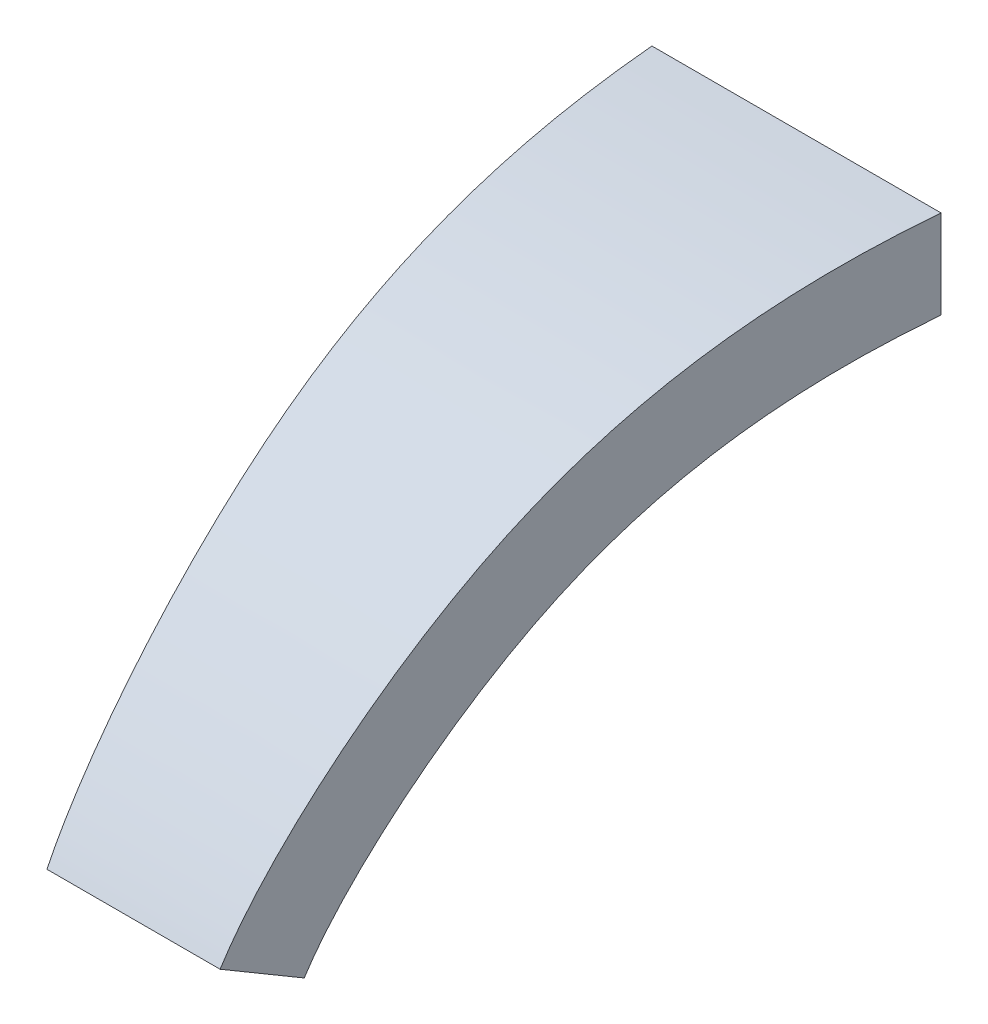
ISO-10303-21;
HEADER;
FILE_DESCRIPTION(('STEP AP214'),'2;1');
FILE_NAME('part.step','',(''),(''),'','','');
FILE_SCHEMA(('AUTOMOTIVE_DESIGN { 1 0 10303 214 1 1 1 1 }'));
ENDSEC;
DATA;
#1=APPLICATION_CONTEXT('core data for automotive mechanical design processes');
#2=APPLICATION_PROTOCOL_DEFINITION('international standard','automotive_design',2000,#1);
#3=PRODUCT_CONTEXT('',#1,'mechanical');
#4=PRODUCT('Part','Part','',(#3));
#5=PRODUCT_RELATED_PRODUCT_CATEGORY('part','',(#4));
#6=PRODUCT_DEFINITION_FORMATION('','',#4);
#7=PRODUCT_DEFINITION_CONTEXT('part definition',#1,'design');
#8=PRODUCT_DEFINITION('design','',#6,#7);
#9=PRODUCT_DEFINITION_SHAPE('','',#8);
#10=(LENGTH_UNIT() NAMED_UNIT(*) SI_UNIT(.MILLI.,.METRE.));
#11=(NAMED_UNIT(*) PLANE_ANGLE_UNIT() SI_UNIT($,.RADIAN.));
#12=(NAMED_UNIT(*) SI_UNIT($,.STERADIAN.) SOLID_ANGLE_UNIT());
#13=UNCERTAINTY_MEASURE_WITH_UNIT(LENGTH_MEASURE(1.E-05),#10,'distance_accuracy_value','');
#14=(GEOMETRIC_REPRESENTATION_CONTEXT(3) GLOBAL_UNCERTAINTY_ASSIGNED_CONTEXT((#13)) GLOBAL_UNIT_ASSIGNED_CONTEXT((#10,
#11,#12)) REPRESENTATION_CONTEXT('',''));
#15=CARTESIAN_POINT('',(0.,0.,0.));
#16=DIRECTION('',(0.,0.,1.));
#17=DIRECTION('',(1.,0.,0.));
#18=AXIS2_PLACEMENT_3D('',#15,#16,#17);
#19=CARTESIAN_POINT('',(12.5,0.,0.));
#20=CARTESIAN_POINT('',(12.5,0.,11.7263333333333));
#21=CARTESIAN_POINT('',(12.5,-3.57446420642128,33.9708660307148));
#22=CARTESIAN_POINT('',(12.5,-23.6672955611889,53.5514562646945));
#23=CARTESIAN_POINT('',(12.5,-30.48,57.3278));
#24=B_SPLINE_CURVE_WITH_KNOTS('',3,(#19,#20,#21,#22,#23),.UNSPECIFIED.,.F.,.F.,(4,1,4),(0.,
0.526025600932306,1.),.UNSPECIFIED.);
#25=DIRECTION('',(-1.,0.,0.));
#26=VECTOR('',#25,1.);
#27=SURFACE_OF_LINEAR_EXTRUSION('',#24,#26);
#28=CARTESIAN_POINT('',(-12.5,0.,0.));
#29=CARTESIAN_POINT('',(-12.4438982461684,4.45529158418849E-08,0.641245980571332));
#30=CARTESIAN_POINT('',(-12.3877948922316,-0.00562268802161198,1.28251025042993));
#31=CARTESIAN_POINT('',(-12.2755037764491,-0.0290246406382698,2.56600357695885));
#32=CARTESIAN_POINT('',(-12.2193160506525,-0.0468263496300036,3.20823222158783));
#33=CARTESIAN_POINT('',(-12.1069123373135,-0.0955344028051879,4.49301254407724));
#34=CARTESIAN_POINT('',(-12.0506964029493,-0.126457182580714,5.13556361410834));
#35=CARTESIAN_POINT('',(-11.9382934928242,-0.202329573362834,6.4203347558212));
#36=CARTESIAN_POINT('',(-11.8821065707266,-0.247289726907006,7.06255421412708));
#37=CARTESIAN_POINT('',(-11.769818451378,-0.352127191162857,8.34601329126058));
#38=CARTESIAN_POINT('',(-11.7137172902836,-0.412009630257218,8.98725249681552));
#39=CARTESIAN_POINT('',(-11.601657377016,-0.547543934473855,10.268103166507));
#40=CARTESIAN_POINT('',(-11.5456986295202,-0.62319631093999,10.907714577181));
#41=CARTESIAN_POINT('',(-11.4340031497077,-0.791043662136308,12.1843997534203));
#42=CARTESIAN_POINT('',(-11.3782663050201,-0.883228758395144,12.8214748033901));
#43=CARTESIAN_POINT('',(-11.2670501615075,-1.08491404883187,14.0926811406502));
#44=CARTESIAN_POINT('',(-11.2115707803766,-1.19440825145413,14.7268133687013));
#45=CARTESIAN_POINT('',(-11.1009253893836,-1.4314084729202,15.9914959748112));
#46=CARTESIAN_POINT('',(-11.0457592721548,-1.55890787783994,16.6220475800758));
#47=CARTESIAN_POINT('',(-10.9357951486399,-1.83255316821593,17.8789432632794));
#48=CARTESIAN_POINT('',(-10.8809970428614,-1.97869378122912,18.5052884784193));
#49=CARTESIAN_POINT('',(-10.771822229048,-2.29019063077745,19.7531623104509));
#50=CARTESIAN_POINT('',(-10.7174454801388,-2.45554497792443,20.3746913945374));
#51=CARTESIAN_POINT('',(-10.6091660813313,-2.8059630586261,21.6123305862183));
#52=CARTESIAN_POINT('',(-10.5552635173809,-2.99103028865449,22.2284397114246));
#53=CARTESIAN_POINT('',(-10.436344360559,-3.42363986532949,23.5876918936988));
#54=CARTESIAN_POINT('',(-10.3714607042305,-3.676015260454,24.3293154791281));
#55=CARTESIAN_POINT('',(-10.2426181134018,-4.21092969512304,25.8019930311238));
#56=CARTESIAN_POINT('',(-10.1786595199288,-4.49347955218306,26.5330430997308));
#57=CARTESIAN_POINT('',(-10.0518154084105,-5.08875502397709,27.9828779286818));
#58=CARTESIAN_POINT('',(-9.9889299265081,-5.40148165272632,28.7016622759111));
#59=CARTESIAN_POINT('',(-9.8643667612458,-6.05683441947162,30.1254257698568));
#60=CARTESIAN_POINT('',(-9.80268882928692,-6.39945432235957,30.8304077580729));
#61=CARTESIAN_POINT('',(-9.71117085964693,-6.93536037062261,31.8764629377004));
#62=CARTESIAN_POINT('',(-9.68083682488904,-7.11762300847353,32.2231825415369));
#63=CARTESIAN_POINT('',(-9.62050807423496,-7.48940735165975,32.9127433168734));
#64=CARTESIAN_POINT('',(-9.59051335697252,-7.67892902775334,33.2555845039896));
#65=CARTESIAN_POINT('',(-9.53095291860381,-8.06464909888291,33.9363634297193));
#66=CARTESIAN_POINT('',(-9.50138629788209,-8.26082921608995,34.2743114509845));
#67=CARTESIAN_POINT('',(-9.44261191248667,-8.66014130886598,34.9461057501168));
#68=CARTESIAN_POINT('',(-9.4134041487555,-8.86327330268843,35.2799520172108));
#69=CARTESIAN_POINT('',(-9.3553381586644,-9.2760426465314,35.9436493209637));
#70=CARTESIAN_POINT('',(-9.32647994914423,-9.485680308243,36.2735001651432));
#71=CARTESIAN_POINT('',(-9.26910961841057,-9.91108998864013,36.9292460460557));
#72=CARTESIAN_POINT('',(-9.24059749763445,-10.1268620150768,37.2551410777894));
#73=CARTESIAN_POINT('',(-9.15555211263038,-10.7830347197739,38.2272142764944));
#74=CARTESIAN_POINT('',(-9.09952814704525,-11.2321613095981,38.8675711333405));
#75=CARTESIAN_POINT('',(-8.98879539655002,-12.1516473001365,40.1332522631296));
#76=CARTESIAN_POINT('',(-8.93408706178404,-12.6220138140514,40.7585713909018));
#77=CARTESIAN_POINT('',(-8.82598141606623,-13.5823190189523,41.9942245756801));
#78=CARTESIAN_POINT('',(-8.77258425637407,-14.0722599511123,42.6045569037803));
#79=CARTESIAN_POINT('',(-8.67367624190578,-15.0083664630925,43.7350806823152));
#80=CARTESIAN_POINT('',(-8.62801108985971,-15.4523896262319,44.2570357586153));
#81=CARTESIAN_POINT('',(-8.53772507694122,-16.3538173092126,45.2890096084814));
#82=CARTESIAN_POINT('',(-8.49310383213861,-16.8112167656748,45.7990327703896));
#83=CARTESIAN_POINT('',(-8.40492903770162,-17.739119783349,46.8068752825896));
#84=CARTESIAN_POINT('',(-8.36137522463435,-18.2096200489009,47.3046976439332));
#85=CARTESIAN_POINT('',(-8.27537705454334,-19.1636792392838,48.2876612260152));
#86=CARTESIAN_POINT('',(-8.23293257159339,-19.6472366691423,48.7728038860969));
#87=CARTESIAN_POINT('',(-8.14921662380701,-20.6276349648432,49.7296815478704));
#88=CARTESIAN_POINT('',(-8.10794526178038,-21.1244769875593,50.2014153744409));
#89=CARTESIAN_POINT('',(-8.02651401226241,-22.1339207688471,51.1321788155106));
#90=CARTESIAN_POINT('',(-7.9863595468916,-22.6465801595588,51.5911464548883));
#91=CARTESIAN_POINT('',(-7.90749286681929,-23.6864441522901,52.4925967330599));
#92=CARTESIAN_POINT('',(-7.86878078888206,-24.2136501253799,52.9350778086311));
#93=CARTESIAN_POINT('',(-7.81198171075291,-25.0160739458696,53.5842942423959));
#94=CARTESIAN_POINT('',(-7.79326377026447,-25.2854299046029,53.7982412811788));
#95=CARTESIAN_POINT('',(-7.75628781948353,-25.8282627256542,54.2208783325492));
#96=CARTESIAN_POINT('',(-7.73802979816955,-26.10173948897,54.4295684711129));
#97=CARTESIAN_POINT('',(-7.70203011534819,-26.6529335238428,54.8410467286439));
#98=CARTESIAN_POINT('',(-7.68428820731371,-26.9306486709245,55.0438376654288));
#99=CARTESIAN_POINT('',(-7.65810192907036,-27.3507362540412,55.3431481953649));
#100=CARTESIAN_POINT('',(-7.64944382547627,-27.4913587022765,55.4421107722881));
#101=CARTESIAN_POINT('',(-7.63227950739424,-27.7738185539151,55.638299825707));
#102=CARTESIAN_POINT('',(-7.6237732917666,-27.9156559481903,55.7355263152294));
#103=CARTESIAN_POINT('',(-7.60691685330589,-28.200704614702,55.9281962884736));
#104=CARTESIAN_POINT('',(-7.59856675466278,-28.3439168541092,56.0236383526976));
#105=CARTESIAN_POINT('',(-7.58204125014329,-28.6316676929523,56.2125257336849));
#106=CARTESIAN_POINT('',(-7.5738658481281,-28.7762063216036,56.3059710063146));
#107=CARTESIAN_POINT('',(-7.5577056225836,-29.0666405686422,56.4906832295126));
#108=CARTESIAN_POINT('',(-7.54972076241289,-29.212535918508,56.5819505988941));
#109=CARTESIAN_POINT('',(-7.53395665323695,-29.5057744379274,56.7621351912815));
#110=CARTESIAN_POINT('',(-7.52617739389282,-29.6531175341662,56.8510525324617));
#111=CARTESIAN_POINT('',(-7.51542925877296,-29.8607488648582,56.9739042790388));
#112=CARTESIAN_POINT('',(-7.51236612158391,-29.9203964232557,57.0089160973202));
#113=CARTESIAN_POINT('',(-7.50627753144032,-30.039943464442,57.0785090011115));
#114=CARTESIAN_POINT('',(-7.50325207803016,-30.0998429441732,57.1130900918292));
#115=CARTESIAN_POINT('',(-7.49724050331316,-30.2199038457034,57.1818027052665));
#116=CARTESIAN_POINT('',(-7.49425438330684,-30.2800652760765,57.2159342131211));
#117=CARTESIAN_POINT('',(-7.4898051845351,-30.3705019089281,57.2667887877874));
#118=CARTESIAN_POINT('',(-7.48832710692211,-30.4006800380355,57.2836832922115));
#119=CARTESIAN_POINT('',(-7.48538252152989,-30.4611105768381,57.3173400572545));
#120=CARTESIAN_POINT('',(-7.48391601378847,-30.4913629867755,57.3341023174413));
#121=CARTESIAN_POINT('',(-7.47951554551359,-30.5821223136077,57.3843998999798));
#122=CARTESIAN_POINT('',(-7.47658094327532,-30.6426250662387,57.417942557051));
#123=CARTESIAN_POINT('',(-7.47071221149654,-30.7636332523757,57.4850224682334));
#124=CARTESIAN_POINT('',(-7.46777808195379,-30.8241386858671,57.51855972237));
#125=CARTESIAN_POINT('',(-7.46190973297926,-30.9451480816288,57.5856352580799));
#126=CARTESIAN_POINT('',(-7.45897551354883,-31.0056520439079,57.6191735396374));
#127=CARTESIAN_POINT('',(-7.45310710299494,-31.1266602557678,57.6862497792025));
#128=CARTESIAN_POINT('',(-7.45017291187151,-31.187164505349,57.7197877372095));
#129=CARTESIAN_POINT('',(-7.44136602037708,-31.36876605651,57.8204509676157));
#130=CARTESIAN_POINT('',(-7.43549331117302,-31.4898633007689,57.8875763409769));
#131=CARTESIAN_POINT('',(-7.42374787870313,-31.7320582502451,58.0218272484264));
#132=CARTESIAN_POINT('',(-7.41787515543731,-31.8531559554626,58.0889527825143));
#133=CARTESIAN_POINT('',(-7.40613005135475,-32.0953442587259,58.2231999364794));
#134=CARTESIAN_POINT('',(-7.4002576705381,-32.2164348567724,58.2903215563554));
#135=CARTESIAN_POINT('',(-7.38851291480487,-32.4586159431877,58.4245647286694));
#136=CARTESIAN_POINT('',(-7.38264053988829,-32.5797064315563,58.4916862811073));
#137=CARTESIAN_POINT('',(-7.36501549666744,-32.943141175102,58.69314144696));
#138=CARTESIAN_POINT('',(-7.35326282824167,-33.1854854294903,58.8274750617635));
#139=CARTESIAN_POINT('',(-7.32975731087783,-33.6701776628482,59.0961443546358));
#140=CARTESIAN_POINT('',(-7.31800446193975,-33.9125256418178,59.2304800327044));
#141=CARTESIAN_POINT('',(-7.29449308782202,-34.3973386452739,59.4992162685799));
#142=CARTESIAN_POINT('',(-7.28273456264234,-34.6398036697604,59.633616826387));
#143=CARTESIAN_POINT('',(-7.25921756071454,-35.1247327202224,59.9024173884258));
#144=CARTESIAN_POINT('',(-7.24745908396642,-35.3671967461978,60.0368173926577));
#145=CARTESIAN_POINT('',(-7.21217596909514,-36.0947472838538,60.4401052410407));
#146=CARTESIAN_POINT('',(-7.18865133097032,-36.5798337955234,60.708993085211));
#147=CARTESIAN_POINT('',(-7.1415982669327,-37.5500849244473,61.2468120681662));
#148=CARTESIAN_POINT('',(-7.11806984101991,-38.0352495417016,61.515743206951));
#149=CARTESIAN_POINT('',(-7.07118993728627,-39.0019300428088,62.0515829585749));
#150=CARTESIAN_POINT('',(-7.04783845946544,-39.4834459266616,62.3184915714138));
#151=CARTESIAN_POINT('',(-7.00113945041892,-40.4463963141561,62.8522636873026));
#152=CARTESIAN_POINT('',(-6.97779191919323,-40.9278308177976,63.1191271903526));
#153=CARTESIAN_POINT('',(-6.93110469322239,-41.890538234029,63.6527646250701));
#154=CARTESIAN_POINT('',(-6.90776499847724,-42.3718111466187,63.9195385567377));
#155=CARTESIAN_POINT('',(-6.86109733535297,-43.3341151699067,64.4529523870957));
#156=CARTESIAN_POINT('',(-6.83776936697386,-43.8151462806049,64.7195922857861));
#157=CARTESIAN_POINT('',(-6.79112904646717,-44.7768864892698,65.2526935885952));
#158=CARTESIAN_POINT('',(-6.76781669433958,-45.2575955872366,65.5191549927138));
#159=CARTESIAN_POINT('',(-6.72121149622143,-46.2186115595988,66.0518548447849));
#160=CARTESIAN_POINT('',(-6.69791865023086,-46.6989184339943,66.3180932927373));
#161=CARTESIAN_POINT('',(-6.67462580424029,-47.1792253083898,66.5843317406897));
#162=B_SPLINE_CURVE_WITH_KNOTS('',3,(#28,#29,#30,#31,#32,#33,#34,#35,#36,#37,#38,#39,#40,#41,
#42,#43,#44,#45,#46,#47,#48,#49,#50,#51,#52,#53,#54,#55,#56,#57,#58,#59,#60,#61,#62,#63,#64,#65,
#66,#67,#68,#69,#70,#71,#72,#73,#74,#75,#76,#77,#78,#79,#80,#81,#82,#83,#84,#85,#86,#87,#88,#89,
#90,#91,#92,#93,#94,#95,#96,#97,#98,#99,#100,#101,#102,#103,#104,#105,#106,#107,#108,#109,#110,
#111,#112,#113,#114,#115,#116,#117,#118,#119,#120,#121,#122,#123,#124,#125,#126,#127,#128,#129,
#130,#131,#132,#133,#134,#135,#136,#137,#138,#139,#140,#141,#142,#143,#144,#145,#146,#147,#148,
#149,#150,#151,#152,#153,#154,#155,#156,#157,#158,#159,#160,#161),.UNSPECIFIED.,.F.,.F.,(4,2,2,
2,2,2,2,2,2,2,2,2,2,2,2,2,2,2,2,2,2,2,2,2,2,2,2,2,2,2,2,2,2,2,2,2,2,2,2,2,2,2,2,2,2,2,2,2,2,2,2,
2,2,2,2,2,2,2,2,2,2,2,2,2,2,2,4),(0.,1.93108904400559,3.86575357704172,5.8028486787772,
7.74140211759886,9.68062270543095,11.6199061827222,13.5580347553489,15.4954939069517,
17.4322432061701,19.3684459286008,21.3044584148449,23.2408148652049,25.5983774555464,
27.9567880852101,30.3152779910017,32.6732771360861,33.851844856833,35.0304078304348,
36.2059624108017,37.3815200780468,38.5571341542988,39.7327497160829,42.0847230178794,
44.4374899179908,46.7905269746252,48.8506638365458,50.9100307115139,52.9688841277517,
55.0275028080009,57.0863013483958,59.1537833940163,61.221460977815,62.2548907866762,
63.2882958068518,64.3211988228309,64.8377043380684,65.354205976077,65.8711023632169,
66.3880101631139,66.9048177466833,67.4215992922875,67.62929330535,67.8369848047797,
68.0446831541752,68.1485334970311,68.2523841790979,68.4601070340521,68.6678288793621,
68.8755484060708,69.0832682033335,69.4990128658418,69.9147589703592,70.3304807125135,
70.7462020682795,71.5782053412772,72.4102213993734,73.2426392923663,74.075053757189,
75.7404267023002,77.4060677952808,79.0591822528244,80.7120173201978,82.3642976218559,
84.0157477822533,85.666092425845,87.3150561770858),.UNSPECIFIED.);
#163=CARTESIAN_POINT('',(-12.5,0.,0.));
#164=VERTEX_POINT('',#163);
#165=CARTESIAN_POINT('',(-7.48446739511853,-30.48,57.3278));
#166=VERTEX_POINT('',#165);
#167=EDGE_CURVE('E85',#164,#166,#162,.T.);
#168=ORIENTED_EDGE('',*,*,#167,.T.);
#169=DIRECTION('',(-1.,0.,0.));
#170=VECTOR('',#169,1.);
#171=CARTESIAN_POINT('',(12.5,-30.48,57.3278));
#172=LINE('',#171,#170);
#173=CARTESIAN_POINT('',(7.48446739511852,-30.48,57.3278));
#174=VERTEX_POINT('',#173);
#175=EDGE_CURVE('E11',#174,#166,#172,.T.);
#176=ORIENTED_EDGE('',*,*,#175,.F.);
#177=CARTESIAN_POINT('',(12.5,0.,0.));
#178=CARTESIAN_POINT('',(12.4438982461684,4.4552915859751E-08,0.64124598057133));
#179=CARTESIAN_POINT('',(12.3877948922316,-0.00562268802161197,1.28251025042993));
#180=CARTESIAN_POINT('',(12.2755037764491,-0.0290246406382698,2.56600357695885));
#181=CARTESIAN_POINT('',(12.2193160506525,-0.0468263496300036,3.20823222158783));
#182=CARTESIAN_POINT('',(12.1069123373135,-0.095534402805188,4.49301254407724));
#183=CARTESIAN_POINT('',(12.0506964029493,-0.126457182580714,5.13556361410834));
#184=CARTESIAN_POINT('',(11.9382934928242,-0.202329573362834,6.4203347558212));
#185=CARTESIAN_POINT('',(11.8821065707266,-0.247289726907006,7.06255421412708));
#186=CARTESIAN_POINT('',(11.769818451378,-0.352127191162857,8.34601329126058));
#187=CARTESIAN_POINT('',(11.7137172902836,-0.412009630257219,8.98725249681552));
#188=CARTESIAN_POINT('',(11.601657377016,-0.547543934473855,10.268103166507));
#189=CARTESIAN_POINT('',(11.5456986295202,-0.62319631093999,10.9077145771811));
#190=CARTESIAN_POINT('',(11.4340031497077,-0.791043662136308,12.1843997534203));
#191=CARTESIAN_POINT('',(11.3782663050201,-0.883228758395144,12.8214748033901));
#192=CARTESIAN_POINT('',(11.2670501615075,-1.08491404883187,14.0926811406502));
#193=CARTESIAN_POINT('',(11.2115707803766,-1.19440825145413,14.7268133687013));
#194=CARTESIAN_POINT('',(11.1009253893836,-1.4314084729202,15.9914959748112));
#195=CARTESIAN_POINT('',(11.0457592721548,-1.55890787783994,16.6220475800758));
#196=CARTESIAN_POINT('',(10.9357951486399,-1.83255316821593,17.8789432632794));
#197=CARTESIAN_POINT('',(10.8809970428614,-1.97869378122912,18.5052884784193));
#198=CARTESIAN_POINT('',(10.771822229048,-2.29019063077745,19.7531623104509));
#199=CARTESIAN_POINT('',(10.7174454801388,-2.45554497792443,20.3746913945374));
#200=CARTESIAN_POINT('',(10.6091660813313,-2.8059630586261,21.6123305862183));
#201=CARTESIAN_POINT('',(10.5552635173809,-2.99103028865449,22.2284397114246));
#202=CARTESIAN_POINT('',(10.436344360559,-3.42363986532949,23.5876918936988));
#203=CARTESIAN_POINT('',(10.3714607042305,-3.676015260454,24.3293154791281));
#204=CARTESIAN_POINT('',(10.2426181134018,-4.21092969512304,25.8019930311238));
#205=CARTESIAN_POINT('',(10.1786595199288,-4.49347955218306,26.5330430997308));
#206=CARTESIAN_POINT('',(10.0518154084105,-5.08875502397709,27.9828779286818));
#207=CARTESIAN_POINT('',(9.9889299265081,-5.40148165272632,28.7016622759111));
#208=CARTESIAN_POINT('',(9.8643667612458,-6.05683441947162,30.1254257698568));
#209=CARTESIAN_POINT('',(9.80268882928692,-6.39945432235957,30.8304077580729));
#210=CARTESIAN_POINT('',(9.71117085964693,-6.93536037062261,31.8764629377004));
#211=CARTESIAN_POINT('',(9.68083682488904,-7.11762300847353,32.2231825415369));
#212=CARTESIAN_POINT('',(9.62050807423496,-7.48940735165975,32.9127433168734));
#213=CARTESIAN_POINT('',(9.59051335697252,-7.67892902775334,33.2555845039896));
#214=CARTESIAN_POINT('',(9.53095291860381,-8.06464909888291,33.9363634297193));
#215=CARTESIAN_POINT('',(9.50138629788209,-8.26082921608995,34.2743114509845));
#216=CARTESIAN_POINT('',(9.44261191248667,-8.66014130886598,34.9461057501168));
#217=CARTESIAN_POINT('',(9.4134041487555,-8.86327330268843,35.2799520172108));
#218=CARTESIAN_POINT('',(9.3553381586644,-9.2760426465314,35.9436493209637));
#219=CARTESIAN_POINT('',(9.32647994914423,-9.485680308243,36.2735001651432));
#220=CARTESIAN_POINT('',(9.26910961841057,-9.91108998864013,36.9292460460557));
#221=CARTESIAN_POINT('',(9.24059749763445,-10.1268620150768,37.2551410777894));
#222=CARTESIAN_POINT('',(9.15555211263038,-10.7830347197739,38.2272142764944));
#223=CARTESIAN_POINT('',(9.09952814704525,-11.2321613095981,38.8675711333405));
#224=CARTESIAN_POINT('',(8.98879539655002,-12.1516473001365,40.1332522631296));
#225=CARTESIAN_POINT('',(8.93408706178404,-12.6220138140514,40.7585713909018));
#226=CARTESIAN_POINT('',(8.82598141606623,-13.5823190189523,41.9942245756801));
#227=CARTESIAN_POINT('',(8.77258425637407,-14.0722599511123,42.6045569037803));
#228=CARTESIAN_POINT('',(8.67367624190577,-15.0083664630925,43.7350806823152));
#229=CARTESIAN_POINT('',(8.62801108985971,-15.4523896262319,44.2570357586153));
#230=CARTESIAN_POINT('',(8.53772507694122,-16.3538173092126,45.2890096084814));
#231=CARTESIAN_POINT('',(8.49310383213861,-16.8112167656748,45.7990327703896));
#232=CARTESIAN_POINT('',(8.40492903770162,-17.739119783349,46.8068752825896));
#233=CARTESIAN_POINT('',(8.36137522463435,-18.2096200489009,47.3046976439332));
#234=CARTESIAN_POINT('',(8.27537705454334,-19.1636792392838,48.2876612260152));
#235=CARTESIAN_POINT('',(8.23293257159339,-19.6472366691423,48.7728038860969));
#236=CARTESIAN_POINT('',(8.14921662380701,-20.6276349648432,49.7296815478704));
#237=CARTESIAN_POINT('',(8.10794526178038,-21.1244769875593,50.2014153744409));
#238=CARTESIAN_POINT('',(8.02651401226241,-22.1339207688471,51.1321788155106));
#239=CARTESIAN_POINT('',(7.9863595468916,-22.6465801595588,51.5911464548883));
#240=CARTESIAN_POINT('',(7.90749286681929,-23.6864441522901,52.4925967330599));
#241=CARTESIAN_POINT('',(7.86878078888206,-24.2136501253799,52.9350778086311));
#242=CARTESIAN_POINT('',(7.81198171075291,-25.0160739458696,53.5842942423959));
#243=CARTESIAN_POINT('',(7.79326377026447,-25.2854299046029,53.7982412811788));
#244=CARTESIAN_POINT('',(7.75628781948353,-25.8282627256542,54.2208783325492));
#245=CARTESIAN_POINT('',(7.73802979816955,-26.10173948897,54.4295684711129));
#246=CARTESIAN_POINT('',(7.70203011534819,-26.6529335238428,54.8410467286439));
#247=CARTESIAN_POINT('',(7.68428820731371,-26.9306486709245,55.0438376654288));
#248=CARTESIAN_POINT('',(7.65810192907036,-27.3507362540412,55.3431481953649));
#249=CARTESIAN_POINT('',(7.64944382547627,-27.4913587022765,55.4421107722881));
#250=CARTESIAN_POINT('',(7.63227950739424,-27.7738185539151,55.638299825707));
#251=CARTESIAN_POINT('',(7.6237732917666,-27.9156559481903,55.7355263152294));
#252=CARTESIAN_POINT('',(7.60691685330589,-28.200704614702,55.9281962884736));
#253=CARTESIAN_POINT('',(7.59856675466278,-28.3439168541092,56.0236383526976));
#254=CARTESIAN_POINT('',(7.58204125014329,-28.6316676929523,56.2125257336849));
#255=CARTESIAN_POINT('',(7.5738658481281,-28.7762063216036,56.3059710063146));
#256=CARTESIAN_POINT('',(7.5577056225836,-29.0666405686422,56.4906832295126));
#257=CARTESIAN_POINT('',(7.54972076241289,-29.212535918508,56.5819505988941));
#258=CARTESIAN_POINT('',(7.53395665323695,-29.5057744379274,56.7621351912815));
#259=CARTESIAN_POINT('',(7.52617739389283,-29.6531175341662,56.8510525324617));
#260=CARTESIAN_POINT('',(7.51542925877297,-29.8607488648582,56.9739042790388));
#261=CARTESIAN_POINT('',(7.51236612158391,-29.9203964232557,57.0089160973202));
#262=CARTESIAN_POINT('',(7.50627753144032,-30.039943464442,57.0785090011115));
#263=CARTESIAN_POINT('',(7.50325207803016,-30.0998429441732,57.1130900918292));
#264=CARTESIAN_POINT('',(7.49724050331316,-30.2199038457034,57.1818027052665));
#265=CARTESIAN_POINT('',(7.49425438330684,-30.2800652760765,57.2159342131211));
#266=CARTESIAN_POINT('',(7.4898051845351,-30.3705019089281,57.2667887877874));
#267=CARTESIAN_POINT('',(7.48832710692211,-30.4006800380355,57.2836832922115));
#268=CARTESIAN_POINT('',(7.48538252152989,-30.4611105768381,57.3173400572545));
#269=CARTESIAN_POINT('',(7.48391601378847,-30.4913629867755,57.3341023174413));
#270=CARTESIAN_POINT('',(7.47951554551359,-30.5821223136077,57.3843998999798));
#271=CARTESIAN_POINT('',(7.47658094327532,-30.6426250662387,57.417942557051));
#272=CARTESIAN_POINT('',(7.47071221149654,-30.7636332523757,57.4850224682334));
#273=CARTESIAN_POINT('',(7.46777808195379,-30.8241386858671,57.51855972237));
#274=CARTESIAN_POINT('',(7.46190973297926,-30.9451480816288,57.5856352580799));
#275=CARTESIAN_POINT('',(7.45897551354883,-31.0056520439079,57.6191735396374));
#276=CARTESIAN_POINT('',(7.45310710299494,-31.1266602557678,57.6862497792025));
#277=CARTESIAN_POINT('',(7.45017291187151,-31.187164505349,57.7197877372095));
#278=CARTESIAN_POINT('',(7.44136602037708,-31.36876605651,57.8204509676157));
#279=CARTESIAN_POINT('',(7.43549331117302,-31.4898633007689,57.8875763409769));
#280=CARTESIAN_POINT('',(7.42374787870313,-31.7320582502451,58.0218272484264));
#281=CARTESIAN_POINT('',(7.41787515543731,-31.8531559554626,58.0889527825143));
#282=CARTESIAN_POINT('',(7.40613005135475,-32.0953442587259,58.2231999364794));
#283=CARTESIAN_POINT('',(7.4002576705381,-32.2164348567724,58.2903215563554));
#284=CARTESIAN_POINT('',(7.38851291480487,-32.4586159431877,58.4245647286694));
#285=CARTESIAN_POINT('',(7.38264053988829,-32.5797064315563,58.4916862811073));
#286=CARTESIAN_POINT('',(7.36501549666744,-32.943141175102,58.69314144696));
#287=CARTESIAN_POINT('',(7.35326282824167,-33.1854854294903,58.8274750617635));
#288=CARTESIAN_POINT('',(7.32975731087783,-33.6701776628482,59.0961443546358));
#289=CARTESIAN_POINT('',(7.31800446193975,-33.9125256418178,59.2304800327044));
#290=CARTESIAN_POINT('',(7.29449308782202,-34.3973386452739,59.4992162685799));
#291=CARTESIAN_POINT('',(7.28273456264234,-34.6398036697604,59.633616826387));
#292=CARTESIAN_POINT('',(7.25921756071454,-35.1247327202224,59.9024173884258));
#293=CARTESIAN_POINT('',(7.24745908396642,-35.3671967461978,60.0368173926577));
#294=CARTESIAN_POINT('',(7.21217596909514,-36.0947472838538,60.4401052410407));
#295=CARTESIAN_POINT('',(7.18865133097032,-36.5798337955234,60.708993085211));
#296=CARTESIAN_POINT('',(7.1415982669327,-37.5500849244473,61.2468120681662));
#297=CARTESIAN_POINT('',(7.11806984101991,-38.0352495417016,61.515743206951));
#298=CARTESIAN_POINT('',(7.07118993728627,-39.0019300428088,62.0515829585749));
#299=CARTESIAN_POINT('',(7.04783845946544,-39.4834459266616,62.3184915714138));
#300=CARTESIAN_POINT('',(7.00113945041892,-40.4463963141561,62.8522636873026));
#301=CARTESIAN_POINT('',(6.97779191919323,-40.9278308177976,63.1191271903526));
#302=CARTESIAN_POINT('',(6.93110469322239,-41.890538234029,63.6527646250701));
#303=CARTESIAN_POINT('',(6.90776499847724,-42.3718111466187,63.9195385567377));
#304=CARTESIAN_POINT('',(6.86109733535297,-43.3341151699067,64.4529523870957));
#305=CARTESIAN_POINT('',(6.83776936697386,-43.8151462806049,64.7195922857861));
#306=CARTESIAN_POINT('',(6.79112904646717,-44.7768864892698,65.2526935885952));
#307=CARTESIAN_POINT('',(6.76781669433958,-45.2575955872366,65.5191549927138));
#308=CARTESIAN_POINT('',(6.72121149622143,-46.2186115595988,66.0518548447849));
#309=CARTESIAN_POINT('',(6.69791865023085,-46.6989184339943,66.3180932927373));
#310=CARTESIAN_POINT('',(6.67462580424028,-47.1792253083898,66.5843317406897));
#311=B_SPLINE_CURVE_WITH_KNOTS('',3,(#177,#178,#179,#180,#181,#182,#183,#184,#185,#186,#187,
#188,#189,#190,#191,#192,#193,#194,#195,#196,#197,#198,#199,#200,#201,#202,#203,#204,#205,#206,
#207,#208,#209,#210,#211,#212,#213,#214,#215,#216,#217,#218,#219,#220,#221,#222,#223,#224,#225,
#226,#227,#228,#229,#230,#231,#232,#233,#234,#235,#236,#237,#238,#239,#240,#241,#242,#243,#244,
#245,#246,#247,#248,#249,#250,#251,#252,#253,#254,#255,#256,#257,#258,#259,#260,#261,#262,#263,
#264,#265,#266,#267,#268,#269,#270,#271,#272,#273,#274,#275,#276,#277,#278,#279,#280,#281,#282,
#283,#284,#285,#286,#287,#288,#289,#290,#291,#292,#293,#294,#295,#296,#297,#298,#299,#300,#301,
#302,#303,#304,#305,#306,#307,#308,#309,#310),.UNSPECIFIED.,.F.,.F.,(4,2,2,2,2,2,2,2,2,2,2,2,2,
2,2,2,2,2,2,2,2,2,2,2,2,2,2,2,2,2,2,2,2,2,2,2,2,2,2,2,2,2,2,2,2,2,2,2,2,2,2,2,2,2,2,2,2,2,2,2,2,
2,2,2,2,2,4),(0.,1.93108904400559,3.86575357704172,5.8028486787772,7.74140211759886,
9.68062270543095,11.6199061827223,13.5580347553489,15.4954939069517,17.4322432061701,
19.3684459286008,21.3044584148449,23.2408148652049,25.5983774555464,27.9567880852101,
30.3152779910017,32.6732771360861,33.851844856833,35.0304078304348,36.2059624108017,
37.3815200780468,38.5571341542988,39.7327497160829,42.0847230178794,44.4374899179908,
46.7905269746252,48.8506638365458,50.9100307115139,52.9688841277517,55.0275028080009,
57.0863013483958,59.1537833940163,61.221460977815,62.2548907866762,63.2882958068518,
64.3211988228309,64.8377043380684,65.354205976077,65.8711023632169,66.3880101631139,
66.9048177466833,67.4215992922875,67.62929330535,67.8369848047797,68.0446831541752,
68.1485334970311,68.2523841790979,68.4601070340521,68.6678288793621,68.8755484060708,
69.0832682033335,69.4990128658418,69.9147589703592,70.3304807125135,70.7462020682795,
71.5782053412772,72.4102213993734,73.2426392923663,74.075053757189,75.7404267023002,
77.4060677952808,79.0591822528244,80.7120173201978,82.3642976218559,84.0157477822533,
85.666092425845,87.3150561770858),.UNSPECIFIED.);
#312=CARTESIAN_POINT('',(12.5,0.,0.));
#313=VERTEX_POINT('',#312);
#314=EDGE_CURVE('E75',#313,#174,#311,.T.);
#315=ORIENTED_EDGE('',*,*,#314,.F.);
#316=DIRECTION('',(-1.,0.,0.));
#317=VECTOR('',#316,1.);
#318=CARTESIAN_POINT('',(12.5,0.,0.));
#319=LINE('',#318,#317);
#320=EDGE_CURVE('E52',#313,#164,#319,.T.);
#321=ORIENTED_EDGE('',*,*,#320,.T.);
#322=EDGE_LOOP('',(#168,#176,#315,#321));
#323=FACE_BOUND('',#322,.T.);
#324=ADVANCED_FACE('F32',(#323),#27,.F.);
#325=CARTESIAN_POINT('',(12.5,-34.1887935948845,50.6369592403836));
#326=DIRECTION('',(0.,-0.874619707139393,0.484809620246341));
#327=DIRECTION('',(0.,-0.484809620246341,-0.874619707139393));
#328=AXIS2_PLACEMENT_3D('',#325,#326,#327);
#329=PLANE('',#328);
#330=DIRECTION('',(0.0762962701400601,0.483396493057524,0.872070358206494));
#331=VECTOR('',#330,1.);
#332=CARTESIAN_POINT('',(-10.2038660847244,-47.7095157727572,26.2449307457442));
#333=LINE('',#332,#331);
#334=CARTESIAN_POINT('',(-8.06984011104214,-34.1887935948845,50.6369592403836));
#335=VERTEX_POINT('',#334);
#336=EDGE_CURVE('E133',#335,#166,#333,.T.);
#337=ORIENTED_EDGE('',*,*,#336,.F.);
#338=DIRECTION('',(-1.,0.,0.));
#339=VECTOR('',#338,1.);
#340=CARTESIAN_POINT('',(12.5,-34.1887935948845,50.6369592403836));
#341=LINE('',#340,#339);
#342=CARTESIAN_POINT('',(8.06984011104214,-34.1887935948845,50.6369592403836));
#343=VERTEX_POINT('',#342);
#344=EDGE_CURVE('E43',#343,#335,#341,.T.);
#345=ORIENTED_EDGE('',*,*,#344,.F.);
#346=DIRECTION('',(0.0762962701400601,-0.483396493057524,-0.872070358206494));
#347=VECTOR('',#346,1.);
#348=CARTESIAN_POINT('',(10.2038660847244,-47.7095157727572,26.2449307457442));
#349=LINE('',#348,#347);
#350=EDGE_CURVE('E37',#343,#174,#349,.F.);
#351=ORIENTED_EDGE('',*,*,#350,.T.);
#352=ORIENTED_EDGE('',*,*,#175,.T.);
#353=EDGE_LOOP('',(#337,#345,#351,#352));
#354=FACE_BOUND('',#353,.T.);
#355=ADVANCED_FACE('F87',(#354),#329,.T.);
#356=CARTESIAN_POINT('',(12.5,-7.65,0.));
#357=CARTESIAN_POINT('',(12.5,-7.65,2.59221544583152));
#358=CARTESIAN_POINT('',(12.5,-7.74898489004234,5.14949098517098));
#359=CARTESIAN_POINT('',(12.5,-8.19927754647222,10.1773210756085));
#360=CARTESIAN_POINT('',(12.5,-8.55040375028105,12.6476460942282));
#361=CARTESIAN_POINT('',(12.5,-9.55631420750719,17.4953218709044));
#362=CARTESIAN_POINT('',(12.5,-10.2107206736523,19.8726311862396));
#363=CARTESIAN_POINT('',(12.5,-11.8800115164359,24.544084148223));
#364=CARTESIAN_POINT('',(12.5,-12.8945798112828,26.8386144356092));
#365=CARTESIAN_POINT('',(12.5,-14.4343794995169,29.6681565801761));
#366=CARTESIAN_POINT('',(12.5,-14.7554142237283,30.2311545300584));
#367=CARTESIAN_POINT('',(12.5,-15.4287387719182,31.3582341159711));
#368=CARTESIAN_POINT('',(12.5,-15.7817687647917,31.9237391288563));
#369=CARTESIAN_POINT('',(12.5,-16.8843763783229,33.6192518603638));
#370=CARTESIAN_POINT('',(12.5,-17.6775248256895,34.7481523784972));
#371=CARTESIAN_POINT('',(12.5,-20.1838696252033,38.0800767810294));
#372=CARTESIAN_POINT('',(12.5,-22.0248005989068,40.2277865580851));
#373=CARTESIAN_POINT('',(12.5,-25.7741553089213,44.135137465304));
#374=CARTESIAN_POINT('',(12.5,-27.6847665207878,45.895900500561));
#375=CARTESIAN_POINT('',(12.5,-30.3597272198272,48.0707725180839));
#376=CARTESIAN_POINT('',(12.5,-31.2191276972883,48.7179241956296));
#377=CARTESIAN_POINT('',(12.5,-32.816149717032,49.8253999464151));
#378=CARTESIAN_POINT('',(12.5,-33.5547366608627,50.2854957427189));
#379=CARTESIAN_POINT('',(12.5,-34.1887935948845,50.6369592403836));
#380=B_SPLINE_CURVE_WITH_KNOTS('',3,(#356,#357,#358,#359,#360,#361,#362,#363,#364,#365,#366,
#367,#368,#369,#370,#371,#372,#373,#374,#375,#376,#377,#378,#379),.UNSPECIFIED.,.F.,.F.,(4,2,2,
2,2,2,2,2,2,2,2,4),(0.,0.124999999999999,0.249999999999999,0.374999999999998,0.499999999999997,
0.531249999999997,0.562499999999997,0.624999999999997,0.749999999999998,0.874999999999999,
0.937499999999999,1.),.UNSPECIFIED.);
#381=DIRECTION('',(-1.,0.,0.));
#382=VECTOR('',#381,1.);
#383=SURFACE_OF_LINEAR_EXTRUSION('',#380,#382);
#384=CARTESIAN_POINT('',(-12.5,-7.65,0.));
#385=CARTESIAN_POINT('',(-12.4483358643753,-7.65000527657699,0.590523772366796));
#386=CARTESIAN_POINT('',(-12.3966701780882,-7.65513720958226,1.18106526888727));
#387=CARTESIAN_POINT('',(-12.2932334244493,-7.67655024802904,2.36335277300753));
#388=CARTESIAN_POINT('',(-12.2414623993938,-7.6928578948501,2.95509829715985));
#389=CARTESIAN_POINT('',(-12.1378739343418,-7.73756334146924,4.13911987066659));
#390=CARTESIAN_POINT('',(-12.0860565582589,-7.76598100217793,4.73139518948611));
#391=CARTESIAN_POINT('',(-11.9824355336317,-7.83585790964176,5.91578892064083));
#392=CARTESIAN_POINT('',(-11.9306319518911,-7.87733030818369,6.50790656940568));
#393=CARTESIAN_POINT('',(-11.8270984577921,-7.97427000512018,7.69129982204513));
#394=CARTESIAN_POINT('',(-11.7753685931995,-8.02974406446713,8.28257487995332));
#395=CARTESIAN_POINT('',(-11.672042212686,-8.15557624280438,9.463600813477));
#396=CARTESIAN_POINT('',(-11.6204457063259,-8.22593540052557,10.0533515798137));
#397=CARTESIAN_POINT('',(-11.5177882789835,-8.3818849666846,11.2267313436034));
#398=CARTESIAN_POINT('',(-11.4667261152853,-8.46736727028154,11.8103745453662));
#399=CARTESIAN_POINT('',(-11.3648522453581,-8.65468367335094,12.9747982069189));
#400=CARTESIAN_POINT('',(-11.3140404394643,-8.7565106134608,13.5555798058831));
#401=CARTESIAN_POINT('',(-11.2127249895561,-8.97728607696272,14.7136206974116));
#402=CARTESIAN_POINT('',(-11.1622212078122,-9.0962262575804,15.2908815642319));
#403=CARTESIAN_POINT('',(-11.0615778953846,-9.35191036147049,16.4412398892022));
#404=CARTESIAN_POINT('',(-11.0114382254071,-9.48864705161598,17.0143389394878));
#405=CARTESIAN_POINT('',(-10.9115787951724,-9.78059496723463,18.1557374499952));
#406=CARTESIAN_POINT('',(-10.8618589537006,-9.93580252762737,18.7240378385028));
#407=CARTESIAN_POINT('',(-10.7628936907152,-10.2652528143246,19.8552159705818));
#408=CARTESIAN_POINT('',(-10.7136483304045,-10.4394979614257,20.4180930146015));
#409=CARTESIAN_POINT('',(-10.6048518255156,-10.8481626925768,21.6616427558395));
#410=CARTESIAN_POINT('',(-10.5454362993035,-11.0873587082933,22.3407653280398));
#411=CARTESIAN_POINT('',(-10.4275374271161,-11.5951734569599,23.6883556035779));
#412=CARTESIAN_POINT('',(-10.3690545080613,-11.8638052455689,24.3568184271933));
#413=CARTESIAN_POINT('',(-10.2531801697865,-12.4306123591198,25.6812681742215));
#414=CARTESIAN_POINT('',(-10.1957888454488,-12.7287902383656,26.3372540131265));
#415=CARTESIAN_POINT('',(-10.0822350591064,-13.3543018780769,27.6351797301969));
#416=CARTESIAN_POINT('',(-10.0260723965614,-13.6816308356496,28.2771219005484));
#417=CARTESIAN_POINT('',(-9.9428395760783,-14.1938254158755,29.2284773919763));
#418=CARTESIAN_POINT('',(-9.91526850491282,-14.3680585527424,29.5436161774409));
#419=CARTESIAN_POINT('',(-9.86047205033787,-14.7235498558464,30.1699425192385));
#420=CARTESIAN_POINT('',(-9.83324666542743,-14.9048079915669,30.4811300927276));
#421=CARTESIAN_POINT('',(-9.7791285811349,-15.2742342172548,31.0997026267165));
#422=CARTESIAN_POINT('',(-9.75223613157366,-15.4624071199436,31.4070847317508));
#423=CARTESIAN_POINT('',(-9.69879187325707,-15.8450088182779,32.0179553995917));
#424=CARTESIAN_POINT('',(-9.67224006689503,-16.0394376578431,32.3214439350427));
#425=CARTESIAN_POINT('',(-9.59308123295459,-16.6315475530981,33.2262335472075));
#426=CARTESIAN_POINT('',(-9.54097278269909,-17.0380383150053,33.8218358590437));
#427=CARTESIAN_POINT('',(-9.43801332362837,-17.8719326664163,34.998667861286));
#428=CARTESIAN_POINT('',(-9.38716288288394,-18.2993454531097,35.5798910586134));
#429=CARTESIAN_POINT('',(-9.2866993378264,-19.173440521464,36.7281946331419));
#430=CARTESIAN_POINT('',(-9.2370868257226,-19.6201317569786,37.2952682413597));
#431=CARTESIAN_POINT('',(-9.13908866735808,-20.5312212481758,38.4153923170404));
#432=CARTESIAN_POINT('',(-9.09070340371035,-20.9956249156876,38.9684384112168));
#433=CARTESIAN_POINT('',(-8.99609943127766,-21.9320550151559,40.0497667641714));
#434=CARTESIAN_POINT('',(-8.94985698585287,-22.4037658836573,40.5783203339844));
#435=CARTESIAN_POINT('',(-8.85865145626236,-23.3625771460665,41.620804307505));
#436=CARTESIAN_POINT('',(-8.8136876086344,-23.849667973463,42.1347434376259));
#437=CARTESIAN_POINT('',(-8.72512891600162,-24.8391588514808,43.1469739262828));
#438=CARTESIAN_POINT('',(-8.68153299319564,-25.3415462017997,43.6452776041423));
#439=CARTESIAN_POINT('',(-8.59579952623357,-26.3616084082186,44.6252156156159));
#440=CARTESIAN_POINT('',(-8.55366069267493,-26.8792689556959,45.1068646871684));
#441=CARTESIAN_POINT('',(-8.49171974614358,-27.6673209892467,45.8148529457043));
#442=CARTESIAN_POINT('',(-8.47131546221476,-27.9315021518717,46.0480749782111));
#443=CARTESIAN_POINT('',(-8.43093887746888,-28.4641747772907,46.5095814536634));
#444=CARTESIAN_POINT('',(-8.4109665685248,-28.7326661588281,46.7378659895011));
#445=CARTESIAN_POINT('',(-8.37149643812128,-29.2743082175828,47.1890116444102));
#446=CARTESIAN_POINT('',(-8.35199872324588,-29.5474599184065,47.4118715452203));
#447=CARTESIAN_POINT('',(-8.31353318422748,-30.0986639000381,47.8515346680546));
#448=CARTESIAN_POINT('',(-8.29456539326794,-30.3767164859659,48.0683375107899));
#449=CARTESIAN_POINT('',(-8.25719795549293,-30.9384654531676,48.4954492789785));
#450=CARTESIAN_POINT('',(-8.23879918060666,-31.2221694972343,48.7057482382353));
#451=CARTESIAN_POINT('',(-8.21172958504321,-31.6520672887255,49.01515513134));
#452=CARTESIAN_POINT('',(-8.20279509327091,-31.7960798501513,49.1172768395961));
#453=CARTESIAN_POINT('',(-8.18512222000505,-32.0856861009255,49.3192787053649));
#454=CARTESIAN_POINT('',(-8.17638384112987,-32.2312798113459,49.4191588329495));
#455=CARTESIAN_POINT('',(-8.15908279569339,-32.5248408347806,49.616910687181));
#456=CARTESIAN_POINT('',(-8.15052115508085,-32.672816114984,49.7147706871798));
#457=CARTESIAN_POINT('',(-8.13363820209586,-32.9705539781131,49.9077437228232));
#458=CARTESIAN_POINT('',(-8.1253168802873,-33.1203164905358,50.0028568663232));
#459=CARTESIAN_POINT('',(-8.10894221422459,-33.4218760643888,50.1900201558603));
#460=CARTESIAN_POINT('',(-8.10088901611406,-33.5736741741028,50.2820686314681));
#461=CARTESIAN_POINT('',(-8.08905068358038,-33.8030244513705,50.4173813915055));
#462=CARTESIAN_POINT('',(-8.08514454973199,-33.8797555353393,50.4620287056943));
#463=CARTESIAN_POINT('',(-8.0774223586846,-34.0338152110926,50.5502937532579));
#464=CARTESIAN_POINT('',(-8.07360630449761,-34.1111438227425,50.5939114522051));
#465=CARTESIAN_POINT('',(-8.06984011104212,-34.1887935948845,50.6369592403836));
#466=B_SPLINE_CURVE_WITH_KNOTS('',3,(#384,#385,#386,#387,#388,#389,#390,#391,#392,#393,#394,
#395,#396,#397,#398,#399,#400,#401,#402,#403,#404,#405,#406,#407,#408,#409,#410,#411,#412,#413,
#414,#415,#416,#417,#418,#419,#420,#421,#422,#423,#424,#425,#426,#427,#428,#429,#430,#431,#432,
#433,#434,#435,#436,#437,#438,#439,#440,#441,#442,#443,#444,#445,#446,#447,#448,#449,#450,#451,
#452,#453,#454,#455,#456,#457,#458,#459,#460,#461,#462,#463,#464,#465),.UNSPECIFIED.,.F.,.F.,(4,
2,2,2,2,2,2,2,2,2,2,2,2,2,2,2,2,2,2,2,2,2,2,2,2,2,2,2,2,2,2,2,2,2,2,2,2,2,2,2,4),(0.,
1.77834278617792,3.56092369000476,5.34643941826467,7.13375972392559,8.92194472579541,
10.7102545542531,12.486262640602,14.2614949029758,16.0358646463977,17.809515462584,
19.5828149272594,21.3563401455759,23.5230493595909,25.6907234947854,27.858585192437,
30.0260903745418,31.1094688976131,32.1928427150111,33.2769854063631,34.3611357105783,
36.5295161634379,38.6988585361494,40.8692195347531,43.0402490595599,45.1697648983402,
47.2979812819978,49.4244764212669,51.5490389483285,52.607953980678,53.6668490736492,
54.7259798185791,55.7851767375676,56.8459234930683,57.3762219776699,57.9065275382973,
58.4393400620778,58.9721316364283,59.5052090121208,59.7717853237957,60.0383705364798),.UNSPECIFIED.);
#467=CARTESIAN_POINT('',(-12.5,-7.65,0.));
#468=VERTEX_POINT('',#467);
#469=EDGE_CURVE('E123',#468,#335,#466,.T.);
#470=ORIENTED_EDGE('',*,*,#469,.F.);
#471=DIRECTION('',(-1.,0.,0.));
#472=VECTOR('',#471,1.);
#473=CARTESIAN_POINT('',(12.5,-7.65,0.));
#474=LINE('',#473,#472);
#475=CARTESIAN_POINT('',(12.5,-7.65,0.));
#476=VERTEX_POINT('',#475);
#477=EDGE_CURVE('E125',#476,#468,#474,.T.);
#478=ORIENTED_EDGE('',*,*,#477,.F.);
#479=CARTESIAN_POINT('',(12.5,-7.65,0.));
#480=CARTESIAN_POINT('',(12.4483503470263,-7.65000527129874,0.590358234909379));
#481=CARTESIAN_POINT('',(12.3966991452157,-7.6551343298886,1.18073417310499));
#482=CARTESIAN_POINT('',(12.2932924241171,-7.67653491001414,2.36267840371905));
#483=CARTESIAN_POINT('',(12.2415369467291,-7.69283273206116,2.95424621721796));
#484=CARTESIAN_POINT('',(12.1379803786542,-7.73751039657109,4.13790320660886));
#485=CARTESIAN_POINT('',(12.08617935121,-7.76590989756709,4.72999165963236));
#486=CARTESIAN_POINT('',(11.982591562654,-7.83574100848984,5.91400550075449));
#487=CARTESIAN_POINT('',(11.9308048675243,-7.87718561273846,6.50593013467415));
#488=CARTESIAN_POINT('',(11.8273054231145,-7.97405907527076,7.68893419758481));
#489=CARTESIAN_POINT('',(11.7755927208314,-8.02949458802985,8.28001308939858));
#490=CARTESIAN_POINT('',(11.6723006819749,-8.15523811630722,9.46064649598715));
#491=CARTESIAN_POINT('',(11.6207213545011,-8.22554712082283,10.0502009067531));
#492=CARTESIAN_POINT('',(11.5180654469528,-8.38143381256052,11.2235632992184));
#493=CARTESIAN_POINT('',(11.4669877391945,-8.46691336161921,11.807384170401));
#494=CARTESIAN_POINT('',(11.3650826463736,-8.65423303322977,12.9721647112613));
#495=CARTESIAN_POINT('',(11.3142551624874,-8.75606605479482,13.5531255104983));
#496=CARTESIAN_POINT('',(11.2129080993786,-8.9768638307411,14.7115277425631));
#497=CARTESIAN_POINT('',(11.1623883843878,-9.09582035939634,15.2889707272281));
#498=CARTESIAN_POINT('',(11.0617128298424,-9.35154882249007,16.4396975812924));
#499=CARTESIAN_POINT('',(11.0115568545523,-9.48831370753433,17.0129830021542));
#500=CARTESIAN_POINT('',(10.9116643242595,-9.78033146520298,18.154759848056));
#501=CARTESIAN_POINT('',(10.8619276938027,-9.93558093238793,18.7232521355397));
#502=CARTESIAN_POINT('',(10.7629282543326,-10.2651305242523,19.8548209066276));
#503=CARTESIAN_POINT('',(10.7136655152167,-10.4394334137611,20.4178965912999));
#504=CARTESIAN_POINT('',(10.6048441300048,-10.8481915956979,21.6617307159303));
#505=CARTESIAN_POINT('',(10.545421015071,-11.0874202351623,22.3409400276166));
#506=CARTESIAN_POINT('',(10.4275072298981,-11.5953078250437,23.6887007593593));
#507=CARTESIAN_POINT('',(10.3690169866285,-11.8639798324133,24.3572472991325));
#508=CARTESIAN_POINT('',(10.2531295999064,-12.4308686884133,25.6818461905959));
#509=CARTESIAN_POINT('',(10.1957325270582,-12.7290874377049,26.3378977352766));
#510=CARTESIAN_POINT('',(10.0821700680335,-13.354672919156,27.6359225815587));
#511=CARTESIAN_POINT('',(10.0260044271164,-13.6820335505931,28.27789879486));
#512=CARTESIAN_POINT('',(9.94276916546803,-14.1942665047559,29.2292821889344));
#513=CARTESIAN_POINT('',(9.91519853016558,-14.3685046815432,29.5444159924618));
#514=CARTESIAN_POINT('',(9.86040295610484,-14.7240059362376,30.1707322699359));
#515=CARTESIAN_POINT('',(9.83317801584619,-14.9052689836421,30.4819147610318));
#516=CARTESIAN_POINT('',(9.77906635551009,-15.2746667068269,31.1004138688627));
#517=CARTESIAN_POINT('',(9.75217981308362,-15.4628048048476,31.4077284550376));
#518=CARTESIAN_POINT('',(9.69874721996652,-15.8453339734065,32.0184657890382));
#519=CARTESIAN_POINT('',(9.6722011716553,-16.0397250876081,32.3218885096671));
#520=CARTESIAN_POINT('',(9.59305958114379,-16.6317165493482,33.2264810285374));
#521=CARTESIAN_POINT('',(9.54096240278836,-17.0381225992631,33.8219545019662));
#522=CARTESIAN_POINT('',(9.43802167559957,-17.8718648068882,34.9985723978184));
#523=CARTESIAN_POINT('',(9.38717877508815,-18.2992114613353,35.579709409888));
#524=CARTESIAN_POINT('',(9.2867235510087,-19.1732255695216,36.7279178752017));
#525=CARTESIAN_POINT('',(9.23711198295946,-19.6199044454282,37.2949806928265));
#526=CARTESIAN_POINT('',(9.1391055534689,-20.5310576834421,38.4151993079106));
#527=CARTESIAN_POINT('',(9.0907113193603,-20.9955409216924,38.9683479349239));
#528=CARTESIAN_POINT('',(9.00235991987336,-21.8700908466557,39.9782090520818));
#529=CARTESIAN_POINT('',(8.96222819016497,-22.2778394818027,40.4369168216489));
#530=CARTESIAN_POINT('',(8.88291480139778,-23.1049312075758,41.3434730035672));
#531=CARTESIAN_POINT('',(8.84373272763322,-23.5242690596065,41.7913261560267));
#532=CARTESIAN_POINT('',(8.76638124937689,-24.3744511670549,42.6754575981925));
#533=CARTESIAN_POINT('',(8.72821114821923,-24.8052870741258,43.1117438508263));
#534=CARTESIAN_POINT('',(8.65294126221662,-25.6783141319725,43.972082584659));
#535=CARTESIAN_POINT('',(8.6158405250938,-26.1204944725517,44.3961459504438));
#536=CARTESIAN_POINT('',(8.54279464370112,-27.0164287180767,45.2310641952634));
#537=CARTESIAN_POINT('',(8.50684834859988,-27.4701702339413,45.6419322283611));
#538=CARTESIAN_POINT('',(8.45391179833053,-28.1599042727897,46.2469997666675));
#539=CARTESIAN_POINT('',(8.43644636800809,-28.3911099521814,46.4466305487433));
#540=CARTESIAN_POINT('',(8.40185729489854,-28.8568625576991,46.8419854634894));
#541=CARTESIAN_POINT('',(8.38473364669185,-29.0914094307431,47.0377096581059));
#542=CARTESIAN_POINT('',(8.35086215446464,-29.5640599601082,47.4248625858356));
#543=CARTESIAN_POINT('',(8.33411431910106,-29.8021636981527,47.6162912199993));
#544=CARTESIAN_POINT('',(8.30102736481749,-30.2821029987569,47.9944768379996));
#545=CARTESIAN_POINT('',(8.28468826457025,-30.5239387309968,48.1812336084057));
#546=CARTESIAN_POINT('',(8.25245350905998,-31.0117899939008,48.5496785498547));
#547=CARTESIAN_POINT('',(8.23655823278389,-31.2578088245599,48.7313623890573));
#548=CARTESIAN_POINT('',(8.20529514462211,-31.7542040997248,49.0887011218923));
#549=CARTESIAN_POINT('',(8.1899272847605,-32.0045801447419,49.2643565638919));
#550=CARTESIAN_POINT('',(8.16733026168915,-32.3842344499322,49.5226417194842));
#551=CARTESIAN_POINT('',(8.15986332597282,-32.5116534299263,49.6079891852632));
#552=CARTESIAN_POINT('',(8.14510109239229,-32.767801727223,49.7767222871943));
#553=CARTESIAN_POINT('',(8.13780580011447,-32.896531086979,49.8601078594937));
#554=CARTESIAN_POINT('',(8.1234037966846,-33.1553994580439,50.0247235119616));
#555=CARTESIAN_POINT('',(8.1162971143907,-33.285538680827,50.1059532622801));
#556=CARTESIAN_POINT('',(8.1022983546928,-33.5473172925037,50.2659598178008));
#557=CARTESIAN_POINT('',(8.09540625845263,-33.678956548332,50.3447368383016));
#558=CARTESIAN_POINT('',(8.0863713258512,-33.8558331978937,50.4480065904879));
#559=CARTESIAN_POINT('',(8.08411746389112,-33.9003262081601,50.4737683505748));
#560=CARTESIAN_POINT('',(8.07964001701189,-33.9895118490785,50.5249458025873));
#561=CARTESIAN_POINT('',(8.07741643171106,-34.0342044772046,50.5503614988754));
#562=CARTESIAN_POINT('',(8.07410430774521,-34.1013963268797,50.5882192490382));
#563=CARTESIAN_POINT('',(8.07300410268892,-34.1238199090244,50.6007946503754));
#564=CARTESIAN_POINT('',(8.07081333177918,-34.1687290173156,50.6258352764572));
#565=CARTESIAN_POINT('',(8.06972276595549,-34.191214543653,50.6383005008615));
#566=CARTESIAN_POINT('',(8.06645117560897,-34.2586721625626,50.6756949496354));
#567=CARTESIAN_POINT('',(8.06427027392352,-34.3036449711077,50.7006227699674));
#568=CARTESIAN_POINT('',(8.05990825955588,-34.3935926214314,50.7504808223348));
#569=CARTESIAN_POINT('',(8.05772714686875,-34.438567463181,50.775411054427));
#570=CARTESIAN_POINT('',(8.05336495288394,-34.5285171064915,50.8252711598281));
#571=CARTESIAN_POINT('',(8.05118387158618,-34.5734919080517,50.8502010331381));
#572=CARTESIAN_POINT('',(8.04464141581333,-34.7083998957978,50.9249816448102));
#573=CARTESIAN_POINT('',(8.04028003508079,-34.7983330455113,50.9748324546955));
#574=CARTESIAN_POINT('',(8.03155762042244,-34.9781923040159,51.0745301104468));
#575=CARTESIAN_POINT('',(8.02719658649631,-35.0681184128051,51.1243769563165));
#576=CARTESIAN_POINT('',(8.01847522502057,-35.2479560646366,51.2240625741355));
#577=CARTESIAN_POINT('',(8.01411489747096,-35.3378676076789,51.2739013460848));
#578=CARTESIAN_POINT('',(8.00975456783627,-35.427779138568,51.3237401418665));
#579=B_SPLINE_CURVE_WITH_KNOTS('',3,(#479,#480,#481,#482,#483,#484,#485,#486,#487,#488,#489,
#490,#491,#492,#493,#494,#495,#496,#497,#498,#499,#500,#501,#502,#503,#504,#505,#506,#507,#508,
#509,#510,#511,#512,#513,#514,#515,#516,#517,#518,#519,#520,#521,#522,#523,#524,#525,#526,#527,
#528,#529,#530,#531,#532,#533,#534,#535,#536,#537,#538,#539,#540,#541,#542,#543,#544,#545,#546,
#547,#548,#549,#550,#551,#552,#553,#554,#555,#556,#557,#558,#559,#560,#561,#562,#563,#564,#565,
#566,#567,#568,#569,#570,#571,#572,#573,#574,#575,#576,#577,#578),.UNSPECIFIED.,.F.,.F.,(4,2,2,
2,2,2,2,2,2,2,2,2,2,2,2,2,2,2,2,2,2,2,2,2,2,2,2,2,2,2,2,2,2,2,2,2,2,2,2,2,2,2,2,2,2,2,2,2,2,4),
(0.,1.77784426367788,3.5598894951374,5.34484066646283,7.13157549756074,8.91916175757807,
10.7068669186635,12.4834030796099,14.2591699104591,16.0340865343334,17.8083026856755,
19.5821924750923,21.3563400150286,23.5233278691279,25.6912806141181,27.8593729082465,
30.027012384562,31.1103850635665,32.1937530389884,33.2776678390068,34.3615902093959,
36.5295074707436,38.6985227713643,40.8688375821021,43.0402488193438,44.8851914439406,
46.7293133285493,48.5721308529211,50.4132531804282,52.252479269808,53.1703344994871,
54.0881751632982,55.0060369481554,55.9239405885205,56.842605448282,57.7611865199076,
58.2218012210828,58.6824308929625,59.1431306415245,59.6037898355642,59.7581758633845,
59.9125599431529,59.9897575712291,60.0669554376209,60.2213522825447,60.3757578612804,
60.5301628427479,60.8389165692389,61.1476460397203,61.4563255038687),.UNSPECIFIED.);
#580=EDGE_CURVE('E88',#476,#343,#579,.T.);
#581=ORIENTED_EDGE('',*,*,#580,.T.);
#582=ORIENTED_EDGE('',*,*,#344,.T.);
#583=EDGE_LOOP('',(#470,#478,#581,#582));
#584=FACE_BOUND('',#583,.T.);
#585=ADVANCED_FACE('F102',(#584),#383,.T.);
#586=CARTESIAN_POINT('',(12.5,0.,0.));
#587=DIRECTION('',(0.,0.,-1.));
#588=DIRECTION('',(0.,1.,0.));
#589=AXIS2_PLACEMENT_3D('',#586,#587,#588);
#590=PLANE('',#589);
#591=DIRECTION('',(0.,-1.,0.));
#592=VECTOR('',#591,1.);
#593=CARTESIAN_POINT('',(-12.5,0.,0.));
#594=LINE('',#593,#592);
#595=EDGE_CURVE('E81',#164,#468,#594,.T.);
#596=ORIENTED_EDGE('',*,*,#595,.F.);
#597=ORIENTED_EDGE('',*,*,#320,.F.);
#598=DIRECTION('',(0.,-1.,0.));
#599=VECTOR('',#598,1.);
#600=CARTESIAN_POINT('',(12.5,0.,0.));
#601=LINE('',#600,#599);
#602=EDGE_CURVE('E79',#313,#476,#601,.T.);
#603=ORIENTED_EDGE('',*,*,#602,.T.);
#604=ORIENTED_EDGE('',*,*,#477,.T.);
#605=EDGE_LOOP('',(#596,#597,#603,#604));
#606=FACE_BOUND('',#605,.T.);
#607=ADVANCED_FACE('F108',(#606),#590,.T.);
#608=CARTESIAN_POINT('',(12.5,0.,0.));
#609=DIRECTION('',(0.996194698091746,0.,0.0871557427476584));
#610=DIRECTION('',(0.0871557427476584,0.,-0.996194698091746));
#611=AXIS2_PLACEMENT_3D('',#608,#609,#610);
#612=PLANE('',#611);
#613=ORIENTED_EDGE('',*,*,#314,.T.);
#614=ORIENTED_EDGE('',*,*,#350,.F.);
#615=ORIENTED_EDGE('',*,*,#580,.F.);
#616=ORIENTED_EDGE('',*,*,#602,.F.);
#617=EDGE_LOOP('',(#613,#614,#615,#616));
#618=FACE_BOUND('',#617,.T.);
#619=ADVANCED_FACE('F34',(#618),#612,.T.);
#620=CARTESIAN_POINT('',(-12.5,0.,0.));
#621=DIRECTION('',(-0.996194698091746,0.,0.0871557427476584));
#622=DIRECTION('',(0.0871557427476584,0.,0.996194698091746));
#623=AXIS2_PLACEMENT_3D('',#620,#621,#622);
#624=PLANE('',#623);
#625=ORIENTED_EDGE('',*,*,#167,.F.);
#626=ORIENTED_EDGE('',*,*,#595,.T.);
#627=ORIENTED_EDGE('',*,*,#469,.T.);
#628=ORIENTED_EDGE('',*,*,#336,.T.);
#629=EDGE_LOOP('',(#625,#626,#627,#628));
#630=FACE_BOUND('',#629,.T.);
#631=ADVANCED_FACE('F134',(#630),#624,.T.);
#632=CLOSED_SHELL('',(#324,#355,#585,#607,#619,#631));
#633=MANIFOLD_SOLID_BREP('B2',#632);
#634=ADVANCED_BREP_SHAPE_REPRESENTATION('',(#18,#633),#14);
#635=SHAPE_DEFINITION_REPRESENTATION(#9,#634);
ENDSEC;
END-ISO-10303-21;
